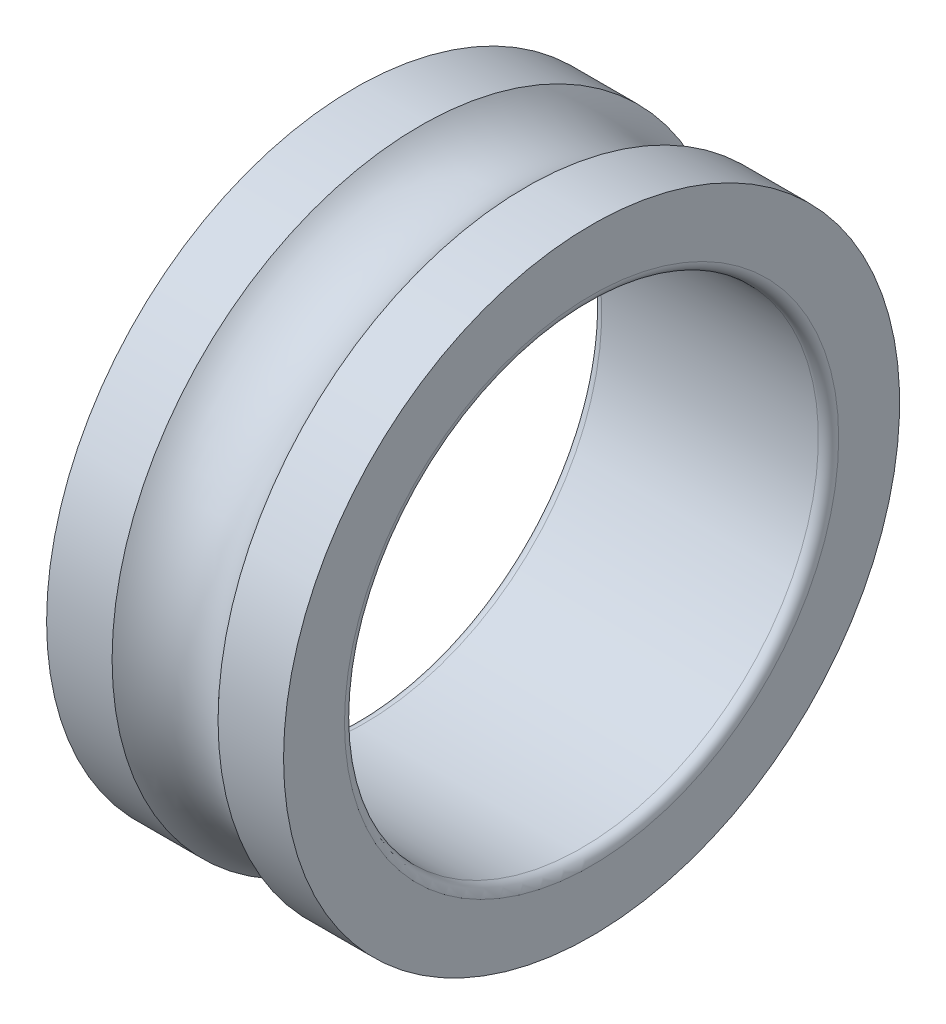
from build123d import *


with BuildPart() as part:
    # Esquisse1 → Base-R_volution (revolve)
    with BuildSketch(Plane(origin=(0, 0, 0), x_dir=(1, 0, 0), z_dir=(0, 1, 0)), mode=Mode.PRIVATE) as base_r_volution_sk:
        with BuildLine():
            Line((0, 4.55), (0, 3.65))
            ThreePointArc((0, 3.65), (0.043933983, 3.543933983), (0.15, 3.5))
            Line((0.15, 3.5), (3.35, 3.5))
            ThreePointArc((3.35, 3.5), (3.456066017, 3.543933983), (3.5, 3.65))
            Line((3.5, 3.65), (3.5, 4.55))
            Line((3.5, 4.55), (2.532623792, 4.55))
            ThreePointArc((2.532623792, 4.55), (1.75, 4.2), (0.967376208, 4.55))
            Line((0.967376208, 4.55), (0, 4.55))
        make_face()
    revolve(base_r_volution_sk.sketch.rotate(Axis((0, 0, 0), (1, 0, 0)), 180), axis=Axis((0, 0, 0), (1, 0, 0)))


solid = part.part
